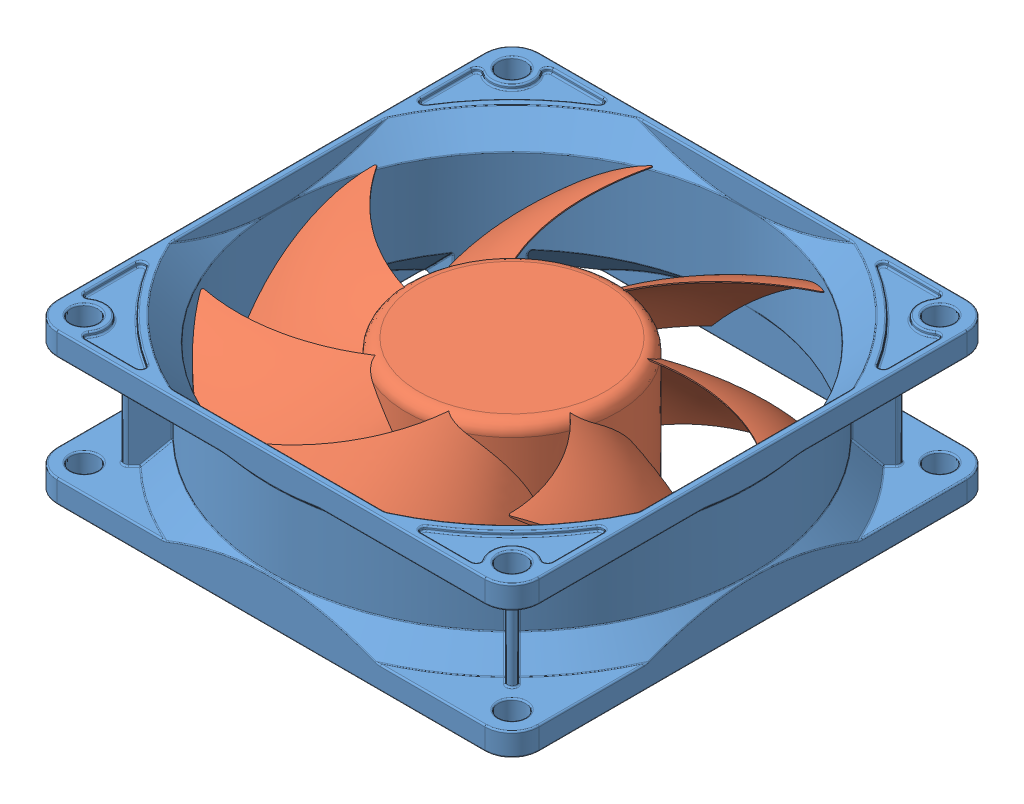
SolidWorks assembly procceror.SLDASM, configuration Default (file format 12000). Lengths in mm.
Overall size (87.11 28.05 86.22).
2 component instances, 2 part files, 2 mates.
Components (placement in the parent):
- Part3-1: Part3.SLDPRT [Default] at origin size (84.27 28.05 84.59)
- fan-1: fan.SLDPRT [Default] at (0 -9.5 0) x (0.994292 0 -0.106694) z (0.106694 0 0.994292) size (79.24 20.79 77.99)
Mates (geometry in assembly coordinates):
- Concentric1: concentric anti-aligned: cylinder of Part3-1 through (0 5.5 0) axis (0 -1 0) radius 1.5; cylinder of fan-1 through (0 3.5 0) axis (0 1 0) radius 1.5
- Coincident1: coincident anti-aligned: plane of Part3-1 through (0 5.5 0) normal (0 1 0); plane of fan-1 through (0 5.5 0) normal (0 -1 0)
